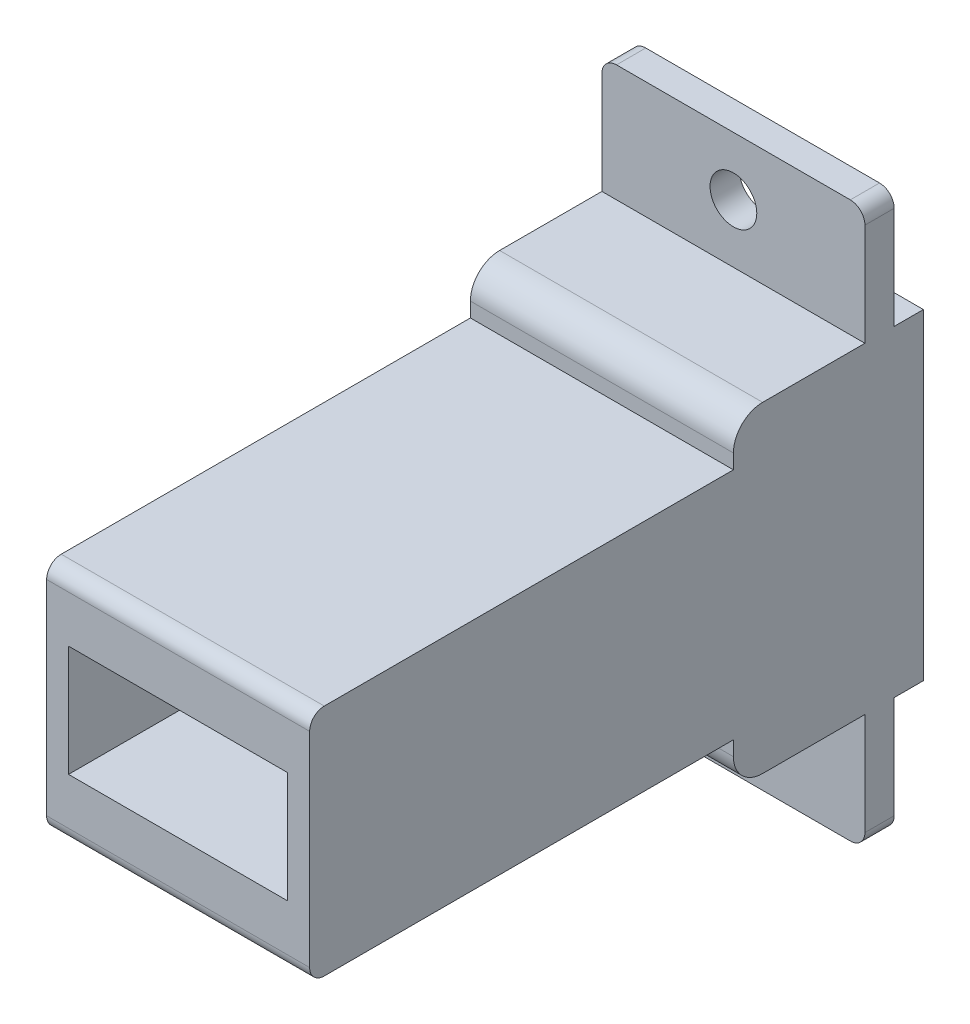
ISO-10303-21;
HEADER;
FILE_DESCRIPTION(('STEP AP214'),'2;1');
FILE_NAME('part.step','',(''),(''),'','','');
FILE_SCHEMA(('AUTOMOTIVE_DESIGN { 1 0 10303 214 1 1 1 1 }'));
ENDSEC;
DATA;
#1=APPLICATION_CONTEXT('core data for automotive mechanical design processes');
#2=APPLICATION_PROTOCOL_DEFINITION('international standard','automotive_design',2000,#1);
#3=PRODUCT_CONTEXT('',#1,'mechanical');
#4=PRODUCT('Part','Part','',(#3));
#5=PRODUCT_RELATED_PRODUCT_CATEGORY('part','',(#4));
#6=PRODUCT_DEFINITION_FORMATION('','',#4);
#7=PRODUCT_DEFINITION_CONTEXT('part definition',#1,'design');
#8=PRODUCT_DEFINITION('design','',#6,#7);
#9=PRODUCT_DEFINITION_SHAPE('','',#8);
#10=(LENGTH_UNIT() NAMED_UNIT(*) SI_UNIT(.MILLI.,.METRE.));
#11=(NAMED_UNIT(*) PLANE_ANGLE_UNIT() SI_UNIT($,.RADIAN.));
#12=(NAMED_UNIT(*) SI_UNIT($,.STERADIAN.) SOLID_ANGLE_UNIT());
#13=UNCERTAINTY_MEASURE_WITH_UNIT(LENGTH_MEASURE(1.E-05),#10,'distance_accuracy_value','');
#14=(GEOMETRIC_REPRESENTATION_CONTEXT(3) GLOBAL_UNCERTAINTY_ASSIGNED_CONTEXT((#13)) GLOBAL_UNIT_ASSIGNED_CONTEXT((#10,
#11,#12)) REPRESENTATION_CONTEXT('',''));
#15=CARTESIAN_POINT('',(0.,0.,0.));
#16=DIRECTION('',(0.,0.,1.));
#17=DIRECTION('',(1.,0.,0.));
#18=AXIS2_PLACEMENT_3D('',#15,#16,#17);
#19=CARTESIAN_POINT('',(0.,0.,0.));
#20=DIRECTION('',(0.,0.,-1.));
#21=DIRECTION('',(-1.,0.,0.));
#22=AXIS2_PLACEMENT_3D('',#19,#20,#21);
#23=PLANE('',#22);
#24=CARTESIAN_POINT('',(0.,15.,0.));
#25=DIRECTION('',(0.,0.,1.));
#26=DIRECTION('',(1.,0.,0.));
#27=AXIS2_PLACEMENT_3D('',#24,#25,#26);
#28=CIRCLE('',#27,1.6);
#29=CARTESIAN_POINT('',(1.6,15.,0.));
#30=VERTEX_POINT('',#29);
#31=EDGE_CURVE('E312',#30,#30,#28,.T.);
#32=ORIENTED_EDGE('',*,*,#31,.T.);
#33=EDGE_LOOP('',(#32));
#34=FACE_BOUND('',#33,.T.);
#35=DIRECTION('',(0.,1.,0.));
#36=VECTOR('',#35,1.);
#37=CARTESIAN_POINT('',(9.,-19.,0.));
#38=LINE('',#37,#36);
#39=CARTESIAN_POINT('',(9.,11.,0.));
#40=VERTEX_POINT('',#39);
#41=CARTESIAN_POINT('',(9.,18.,0.));
#42=VERTEX_POINT('',#41);
#43=EDGE_CURVE('E246',#40,#42,#38,.T.);
#44=ORIENTED_EDGE('',*,*,#43,.F.);
#45=DIRECTION('',(-1.,0.,0.));
#46=VECTOR('',#45,1.);
#47=CARTESIAN_POINT('',(9.,11.,0.));
#48=LINE('',#47,#46);
#49=CARTESIAN_POINT('',(-9.,11.,0.));
#50=VERTEX_POINT('',#49);
#51=EDGE_CURVE('E687',#40,#50,#48,.T.);
#52=ORIENTED_EDGE('',*,*,#51,.T.);
#53=DIRECTION('',(0.,-1.,0.));
#54=VECTOR('',#53,1.);
#55=CARTESIAN_POINT('',(-9.,-19.,0.));
#56=LINE('',#55,#54);
#57=CARTESIAN_POINT('',(-9.,18.,0.));
#58=VERTEX_POINT('',#57);
#59=EDGE_CURVE('E270',#58,#50,#56,.T.);
#60=ORIENTED_EDGE('',*,*,#59,.F.);
#61=CARTESIAN_POINT('',(-8.,18.,0.));
#62=DIRECTION('',(0.,0.,-1.));
#63=DIRECTION('',(-1.,0.,0.));
#64=AXIS2_PLACEMENT_3D('',#61,#62,#63);
#65=CIRCLE('',#64,1.);
#66=CARTESIAN_POINT('',(-8.,19.,0.));
#67=VERTEX_POINT('',#66);
#68=EDGE_CURVE('E291',#58,#67,#65,.T.);
#69=ORIENTED_EDGE('',*,*,#68,.T.);
#70=DIRECTION('',(-1.,0.,0.));
#71=VECTOR('',#70,1.);
#72=CARTESIAN_POINT('',(-9.,19.,0.));
#73=LINE('',#72,#71);
#74=CARTESIAN_POINT('',(8.,19.,0.));
#75=VERTEX_POINT('',#74);
#76=EDGE_CURVE('E245',#75,#67,#73,.T.);
#77=ORIENTED_EDGE('',*,*,#76,.F.);
#78=CARTESIAN_POINT('',(8.,18.,0.));
#79=DIRECTION('',(0.,0.,-1.));
#80=DIRECTION('',(-1.,0.,0.));
#81=AXIS2_PLACEMENT_3D('',#78,#79,#80);
#82=CIRCLE('',#81,1.);
#83=EDGE_CURVE('E662',#75,#42,#82,.T.);
#84=ORIENTED_EDGE('',*,*,#83,.T.);
#85=EDGE_LOOP('',(#44,#52,#60,#69,#77,#84));
#86=FACE_BOUND('',#85,.T.);
#87=ADVANCED_FACE('F32',(#34,#86),#23,.T.);
#88=CARTESIAN_POINT('',(0.,0.,2.));
#89=DIRECTION('',(0.,0.,-1.));
#90=DIRECTION('',(-1.,0.,0.));
#91=AXIS2_PLACEMENT_3D('',#88,#89,#90);
#92=PLANE('',#91);
#93=CARTESIAN_POINT('',(0.,15.,2.));
#94=DIRECTION('',(0.,0.,1.));
#95=DIRECTION('',(1.,0.,0.));
#96=AXIS2_PLACEMENT_3D('',#93,#94,#95);
#97=CIRCLE('',#96,1.6);
#98=CARTESIAN_POINT('',(1.6,15.,2.));
#99=VERTEX_POINT('',#98);
#100=EDGE_CURVE('E250',#99,#99,#97,.T.);
#101=ORIENTED_EDGE('',*,*,#100,.F.);
#102=EDGE_LOOP('',(#101));
#103=FACE_BOUND('',#102,.T.);
#104=DIRECTION('',(-1.,0.,0.));
#105=VECTOR('',#104,1.);
#106=CARTESIAN_POINT('',(9.,11.,2.));
#107=LINE('',#106,#105);
#108=CARTESIAN_POINT('',(9.,11.,2.));
#109=VERTEX_POINT('',#108);
#110=CARTESIAN_POINT('',(-9.,11.,2.));
#111=VERTEX_POINT('',#110);
#112=EDGE_CURVE('E359',#109,#111,#107,.T.);
#113=ORIENTED_EDGE('',*,*,#112,.F.);
#114=DIRECTION('',(0.,1.,0.));
#115=VECTOR('',#114,1.);
#116=CARTESIAN_POINT('',(9.,-19.,2.));
#117=LINE('',#116,#115);
#118=CARTESIAN_POINT('',(9.,18.,2.));
#119=VERTEX_POINT('',#118);
#120=EDGE_CURVE('E276',#109,#119,#117,.T.);
#121=ORIENTED_EDGE('',*,*,#120,.T.);
#122=CARTESIAN_POINT('',(8.,18.,2.));
#123=DIRECTION('',(0.,0.,-1.));
#124=DIRECTION('',(-1.,0.,0.));
#125=AXIS2_PLACEMENT_3D('',#122,#123,#124);
#126=CIRCLE('',#125,1.);
#127=CARTESIAN_POINT('',(8.,19.,2.));
#128=VERTEX_POINT('',#127);
#129=EDGE_CURVE('E674',#119,#128,#126,.F.);
#130=ORIENTED_EDGE('',*,*,#129,.T.);
#131=DIRECTION('',(-1.,0.,0.));
#132=VECTOR('',#131,1.);
#133=CARTESIAN_POINT('',(-9.,19.,2.));
#134=LINE('',#133,#132);
#135=CARTESIAN_POINT('',(-8.,19.,2.));
#136=VERTEX_POINT('',#135);
#137=EDGE_CURVE('E307',#128,#136,#134,.T.);
#138=ORIENTED_EDGE('',*,*,#137,.T.);
#139=CARTESIAN_POINT('',(-8.,18.,2.));
#140=DIRECTION('',(0.,0.,-1.));
#141=DIRECTION('',(-1.,0.,0.));
#142=AXIS2_PLACEMENT_3D('',#139,#140,#141);
#143=CIRCLE('',#142,1.);
#144=CARTESIAN_POINT('',(-9.,18.,2.));
#145=VERTEX_POINT('',#144);
#146=EDGE_CURVE('E676',#136,#145,#143,.F.);
#147=ORIENTED_EDGE('',*,*,#146,.T.);
#148=DIRECTION('',(0.,-1.,0.));
#149=VECTOR('',#148,1.);
#150=CARTESIAN_POINT('',(-9.,-19.,2.));
#151=LINE('',#150,#149);
#152=EDGE_CURVE('E321',#145,#111,#151,.T.);
#153=ORIENTED_EDGE('',*,*,#152,.T.);
#154=EDGE_LOOP('',(#113,#121,#130,#138,#147,#153));
#155=FACE_BOUND('',#154,.T.);
#156=ADVANCED_FACE('F397',(#103,#155),#92,.F.);
#157=CARTESIAN_POINT('',(9.,-18.,2.));
#158=VERTEX_POINT('',#157);
#159=CARTESIAN_POINT('',(9.,-11.,2.));
#160=VERTEX_POINT('',#159);
#161=EDGE_CURVE('E303',#158,#160,#117,.T.);
#162=ORIENTED_EDGE('',*,*,#161,.T.);
#163=DIRECTION('',(-1.,0.,0.));
#164=VECTOR('',#163,1.);
#165=CARTESIAN_POINT('',(9.,-11.,2.));
#166=LINE('',#165,#164);
#167=CARTESIAN_POINT('',(-9.,-11.,2.));
#168=VERTEX_POINT('',#167);
#169=EDGE_CURVE('E334',#160,#168,#166,.T.);
#170=ORIENTED_EDGE('',*,*,#169,.T.);
#171=CARTESIAN_POINT('',(-9.,-18.,2.));
#172=VERTEX_POINT('',#171);
#173=EDGE_CURVE('E316',#168,#172,#151,.T.);
#174=ORIENTED_EDGE('',*,*,#173,.T.);
#175=CARTESIAN_POINT('',(-8.,-18.,2.));
#176=DIRECTION('',(0.,0.,-1.));
#177=DIRECTION('',(-1.,0.,0.));
#178=AXIS2_PLACEMENT_3D('',#175,#176,#177);
#179=CIRCLE('',#178,1.);
#180=CARTESIAN_POINT('',(-8.,-19.,2.));
#181=VERTEX_POINT('',#180);
#182=EDGE_CURVE('E294',#172,#181,#179,.F.);
#183=ORIENTED_EDGE('',*,*,#182,.T.);
#184=DIRECTION('',(1.,0.,0.));
#185=VECTOR('',#184,1.);
#186=CARTESIAN_POINT('',(-9.,-19.,2.));
#187=LINE('',#186,#185);
#188=CARTESIAN_POINT('',(8.,-19.,2.));
#189=VERTEX_POINT('',#188);
#190=EDGE_CURVE('E259',#181,#189,#187,.T.);
#191=ORIENTED_EDGE('',*,*,#190,.T.);
#192=CARTESIAN_POINT('',(8.,-18.,2.));
#193=DIRECTION('',(0.,0.,-1.));
#194=DIRECTION('',(-1.,0.,0.));
#195=AXIS2_PLACEMENT_3D('',#192,#193,#194);
#196=CIRCLE('',#195,1.);
#197=EDGE_CURVE('E299',#189,#158,#196,.F.);
#198=ORIENTED_EDGE('',*,*,#197,.T.);
#199=EDGE_LOOP('',(#162,#170,#174,#183,#191,#198));
#200=FACE_BOUND('',#199,.T.);
#201=CARTESIAN_POINT('',(0.,-15.,2.));
#202=DIRECTION('',(0.,0.,1.));
#203=DIRECTION('',(1.,0.,0.));
#204=AXIS2_PLACEMENT_3D('',#201,#202,#203);
#205=CIRCLE('',#204,1.6);
#206=CARTESIAN_POINT('',(1.6,-15.,2.));
#207=VERTEX_POINT('',#206);
#208=EDGE_CURVE('E369',#207,#207,#205,.T.);
#209=ORIENTED_EDGE('',*,*,#208,.F.);
#210=EDGE_LOOP('',(#209));
#211=FACE_BOUND('',#210,.T.);
#212=ADVANCED_FACE('F330',(#200,#211),#92,.F.);
#213=DIRECTION('',(-1.,0.,0.));
#214=VECTOR('',#213,1.);
#215=CARTESIAN_POINT('',(9.,-11.,0.));
#216=LINE('',#215,#214);
#217=CARTESIAN_POINT('',(9.,-11.,0.));
#218=VERTEX_POINT('',#217);
#219=CARTESIAN_POINT('',(-9.,-11.,0.));
#220=VERTEX_POINT('',#219);
#221=EDGE_CURVE('E223',#218,#220,#216,.T.);
#222=ORIENTED_EDGE('',*,*,#221,.F.);
#223=CARTESIAN_POINT('',(9.,-18.,0.));
#224=VERTEX_POINT('',#223);
#225=EDGE_CURVE('E236',#224,#218,#38,.T.);
#226=ORIENTED_EDGE('',*,*,#225,.F.);
#227=CARTESIAN_POINT('',(8.,-18.,0.));
#228=DIRECTION('',(0.,0.,-1.));
#229=DIRECTION('',(-1.,0.,0.));
#230=AXIS2_PLACEMENT_3D('',#227,#228,#229);
#231=CIRCLE('',#230,1.);
#232=CARTESIAN_POINT('',(8.,-19.,0.));
#233=VERTEX_POINT('',#232);
#234=EDGE_CURVE('E290',#224,#233,#231,.T.);
#235=ORIENTED_EDGE('',*,*,#234,.T.);
#236=DIRECTION('',(1.,0.,0.));
#237=VECTOR('',#236,1.);
#238=CARTESIAN_POINT('',(-9.,-19.,0.));
#239=LINE('',#238,#237);
#240=CARTESIAN_POINT('',(-8.,-19.,0.));
#241=VERTEX_POINT('',#240);
#242=EDGE_CURVE('E265',#241,#233,#239,.T.);
#243=ORIENTED_EDGE('',*,*,#242,.F.);
#244=CARTESIAN_POINT('',(-8.,-18.,0.));
#245=DIRECTION('',(0.,0.,-1.));
#246=DIRECTION('',(-1.,0.,0.));
#247=AXIS2_PLACEMENT_3D('',#244,#245,#246);
#248=CIRCLE('',#247,1.);
#249=CARTESIAN_POINT('',(-9.,-18.,0.));
#250=VERTEX_POINT('',#249);
#251=EDGE_CURVE('E286',#241,#250,#248,.T.);
#252=ORIENTED_EDGE('',*,*,#251,.T.);
#253=EDGE_CURVE('E238',#220,#250,#56,.T.);
#254=ORIENTED_EDGE('',*,*,#253,.F.);
#255=EDGE_LOOP('',(#222,#226,#235,#243,#252,#254));
#256=FACE_BOUND('',#255,.T.);
#257=CARTESIAN_POINT('',(0.,-15.,0.));
#258=DIRECTION('',(0.,0.,1.));
#259=DIRECTION('',(1.,0.,0.));
#260=AXIS2_PLACEMENT_3D('',#257,#258,#259);
#261=CIRCLE('',#260,1.6);
#262=CARTESIAN_POINT('',(1.6,-15.,0.));
#263=VERTEX_POINT('',#262);
#264=EDGE_CURVE('E362',#263,#263,#261,.T.);
#265=ORIENTED_EDGE('',*,*,#264,.T.);
#266=EDGE_LOOP('',(#265));
#267=FACE_BOUND('',#266,.T.);
#268=ADVANCED_FACE('F234',(#256,#267),#23,.T.);
#269=CARTESIAN_POINT('',(9.,-19.,2.));
#270=DIRECTION('',(-1.,0.,0.));
#271=DIRECTION('',(0.,0.,1.));
#272=AXIS2_PLACEMENT_3D('',#269,#270,#271);
#273=PLANE('',#272);
#274=ORIENTED_EDGE('',*,*,#161,.F.);
#275=DIRECTION('',(0.,0.,-1.));
#276=VECTOR('',#275,1.);
#277=CARTESIAN_POINT('',(9.,-18.,2.));
#278=LINE('',#277,#276);
#279=EDGE_CURVE('E244',#158,#224,#278,.T.);
#280=ORIENTED_EDGE('',*,*,#279,.T.);
#281=ORIENTED_EDGE('',*,*,#225,.T.);
#282=DIRECTION('',(0.,0.,-1.));
#283=VECTOR('',#282,1.);
#284=CARTESIAN_POINT('',(9.,-11.,-2.));
#285=LINE('',#284,#283);
#286=CARTESIAN_POINT('',(9.,-11.,-2.));
#287=VERTEX_POINT('',#286);
#288=EDGE_CURVE('E220',#218,#287,#285,.T.);
#289=ORIENTED_EDGE('',*,*,#288,.T.);
#290=DIRECTION('',(0.,1.,0.));
#291=VECTOR('',#290,1.);
#292=CARTESIAN_POINT('',(9.,11.,-2.));
#293=LINE('',#292,#291);
#294=CARTESIAN_POINT('',(9.,11.,-2.));
#295=VERTEX_POINT('',#294);
#296=EDGE_CURVE('E230',#287,#295,#293,.T.);
#297=ORIENTED_EDGE('',*,*,#296,.T.);
#298=DIRECTION('',(0.,0.,1.));
#299=VECTOR('',#298,1.);
#300=CARTESIAN_POINT('',(9.,11.,0.));
#301=LINE('',#300,#299);
#302=EDGE_CURVE('E690',#295,#40,#301,.T.);
#303=ORIENTED_EDGE('',*,*,#302,.T.);
#304=ORIENTED_EDGE('',*,*,#43,.T.);
#305=DIRECTION('',(0.,0.,-1.));
#306=VECTOR('',#305,1.);
#307=CARTESIAN_POINT('',(9.,18.,2.));
#308=LINE('',#307,#306);
#309=EDGE_CURVE('E327',#42,#119,#308,.F.);
#310=ORIENTED_EDGE('',*,*,#309,.T.);
#311=ORIENTED_EDGE('',*,*,#120,.F.);
#312=DIRECTION('',(0.,0.,1.));
#313=VECTOR('',#312,1.);
#314=CARTESIAN_POINT('',(9.,11.,2.));
#315=LINE('',#314,#313);
#316=CARTESIAN_POINT('',(9.,11.,8.99999999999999));
#317=VERTEX_POINT('',#316);
#318=EDGE_CURVE('E342',#109,#317,#315,.T.);
#319=ORIENTED_EDGE('',*,*,#318,.T.);
#320=CARTESIAN_POINT('',(9.,9.,9.));
#321=DIRECTION('',(1.,0.,0.));
#322=DIRECTION('',(0.,0.,-1.));
#323=AXIS2_PLACEMENT_3D('',#320,#321,#322);
#324=CIRCLE('',#323,2.);
#325=CARTESIAN_POINT('',(9.,8.99999999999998,11.));
#326=VERTEX_POINT('',#325);
#327=EDGE_CURVE('E344',#317,#326,#324,.T.);
#328=ORIENTED_EDGE('',*,*,#327,.T.);
#329=DIRECTION('',(0.,-1.,0.));
#330=VECTOR('',#329,1.);
#331=CARTESIAN_POINT('',(9.,8.99999999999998,11.));
#332=LINE('',#331,#330);
#333=CARTESIAN_POINT('',(9.,8.,11.));
#334=VERTEX_POINT('',#333);
#335=EDGE_CURVE('E639',#326,#334,#332,.T.);
#336=ORIENTED_EDGE('',*,*,#335,.T.);
#337=DIRECTION('',(0.,0.,1.));
#338=VECTOR('',#337,1.);
#339=CARTESIAN_POINT('',(9.,8.,11.));
#340=LINE('',#339,#338);
#341=CARTESIAN_POINT('',(9.,7.99999999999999,39.));
#342=VERTEX_POINT('',#341);
#343=EDGE_CURVE('E641',#334,#342,#340,.T.);
#344=ORIENTED_EDGE('',*,*,#343,.T.);
#345=CARTESIAN_POINT('',(9.,6.99999999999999,39.));
#346=DIRECTION('',(1.,0.,0.));
#347=DIRECTION('',(0.,0.,-1.));
#348=AXIS2_PLACEMENT_3D('',#345,#346,#347);
#349=CIRCLE('',#348,1.);
#350=CARTESIAN_POINT('',(9.,6.99999999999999,40.));
#351=VERTEX_POINT('',#350);
#352=EDGE_CURVE('E643',#342,#351,#349,.T.);
#353=ORIENTED_EDGE('',*,*,#352,.T.);
#354=DIRECTION('',(0.,-1.,0.));
#355=VECTOR('',#354,1.);
#356=CARTESIAN_POINT('',(9.,6.99999999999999,40.));
#357=LINE('',#356,#355);
#358=CARTESIAN_POINT('',(9.,-7.,40.));
#359=VERTEX_POINT('',#358);
#360=EDGE_CURVE('E649',#351,#359,#357,.T.);
#361=ORIENTED_EDGE('',*,*,#360,.T.);
#362=CARTESIAN_POINT('',(9.,-7.00000000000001,39.));
#363=DIRECTION('',(1.,0.,0.));
#364=DIRECTION('',(0.,0.,1.));
#365=AXIS2_PLACEMENT_3D('',#362,#363,#364);
#366=CIRCLE('',#365,1.);
#367=CARTESIAN_POINT('',(9.,-8.00000000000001,39.));
#368=VERTEX_POINT('',#367);
#369=EDGE_CURVE('E651',#359,#368,#366,.T.);
#370=ORIENTED_EDGE('',*,*,#369,.T.);
#371=DIRECTION('',(0.,0.,-1.));
#372=VECTOR('',#371,1.);
#373=CARTESIAN_POINT('',(9.,-8.,11.));
#374=LINE('',#373,#372);
#375=CARTESIAN_POINT('',(9.,-8.,11.));
#376=VERTEX_POINT('',#375);
#377=EDGE_CURVE('E653',#368,#376,#374,.T.);
#378=ORIENTED_EDGE('',*,*,#377,.T.);
#379=DIRECTION('',(0.,-1.,0.));
#380=VECTOR('',#379,1.);
#381=CARTESIAN_POINT('',(9.,-8.,11.));
#382=LINE('',#381,#380);
#383=CARTESIAN_POINT('',(9.,-8.99999999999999,11.));
#384=VERTEX_POINT('',#383);
#385=EDGE_CURVE('E654',#376,#384,#382,.T.);
#386=ORIENTED_EDGE('',*,*,#385,.T.);
#387=CARTESIAN_POINT('',(9.,-9.,9.));
#388=DIRECTION('',(1.,0.,0.));
#389=DIRECTION('',(0.,0.,1.));
#390=AXIS2_PLACEMENT_3D('',#387,#388,#389);
#391=CIRCLE('',#390,2.);
#392=CARTESIAN_POINT('',(9.,-11.,8.99999999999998));
#393=VERTEX_POINT('',#392);
#394=EDGE_CURVE('E354',#384,#393,#391,.T.);
#395=ORIENTED_EDGE('',*,*,#394,.T.);
#396=DIRECTION('',(0.,0.,-1.));
#397=VECTOR('',#396,1.);
#398=CARTESIAN_POINT('',(9.,-11.,2.));
#399=LINE('',#398,#397);
#400=EDGE_CURVE('E352',#393,#160,#399,.T.);
#401=ORIENTED_EDGE('',*,*,#400,.T.);
#402=EDGE_LOOP('',(#274,#280,#281,#289,#297,#303,#304,#310,#311,#319,#328,#336,#344,#353,#361,
#370,#378,#386,#395,#401));
#403=FACE_BOUND('',#402,.T.);
#404=ADVANCED_FACE('F242',(#403),#273,.F.);
#405=CARTESIAN_POINT('',(-9.,19.,2.));
#406=DIRECTION('',(0.,-1.,0.));
#407=DIRECTION('',(0.,0.,-1.));
#408=AXIS2_PLACEMENT_3D('',#405,#406,#407);
#409=PLANE('',#408);
#410=ORIENTED_EDGE('',*,*,#76,.T.);
#411=DIRECTION('',(0.,0.,-1.));
#412=VECTOR('',#411,1.);
#413=CARTESIAN_POINT('',(-8.,19.,2.));
#414=LINE('',#413,#412);
#415=EDGE_CURVE('E11',#67,#136,#414,.F.);
#416=ORIENTED_EDGE('',*,*,#415,.T.);
#417=ORIENTED_EDGE('',*,*,#137,.F.);
#418=DIRECTION('',(0.,0.,-1.));
#419=VECTOR('',#418,1.);
#420=CARTESIAN_POINT('',(8.,19.,2.));
#421=LINE('',#420,#419);
#422=EDGE_CURVE('E41',#128,#75,#421,.T.);
#423=ORIENTED_EDGE('',*,*,#422,.T.);
#424=EDGE_LOOP('',(#410,#416,#417,#423));
#425=FACE_BOUND('',#424,.T.);
#426=ADVANCED_FACE('F408',(#425),#409,.F.);
#427=CARTESIAN_POINT('',(-9.,-19.,2.));
#428=DIRECTION('',(1.,0.,0.));
#429=DIRECTION('',(0.,0.,-1.));
#430=AXIS2_PLACEMENT_3D('',#427,#428,#429);
#431=PLANE('',#430);
#432=ORIENTED_EDGE('',*,*,#59,.T.);
#433=DIRECTION('',(0.,0.,1.));
#434=VECTOR('',#433,1.);
#435=CARTESIAN_POINT('',(-9.,11.,0.));
#436=LINE('',#435,#434);
#437=CARTESIAN_POINT('',(-9.,11.,-2.));
#438=VERTEX_POINT('',#437);
#439=EDGE_CURVE('E49',#438,#50,#436,.T.);
#440=ORIENTED_EDGE('',*,*,#439,.F.);
#441=DIRECTION('',(0.,1.,0.));
#442=VECTOR('',#441,1.);
#443=CARTESIAN_POINT('',(-9.,11.,-2.));
#444=LINE('',#443,#442);
#445=CARTESIAN_POINT('',(-9.,-11.,-2.));
#446=VERTEX_POINT('',#445);
#447=EDGE_CURVE('E700',#446,#438,#444,.T.);
#448=ORIENTED_EDGE('',*,*,#447,.F.);
#449=DIRECTION('',(0.,0.,-1.));
#450=VECTOR('',#449,1.);
#451=CARTESIAN_POINT('',(-9.,-11.,-2.));
#452=LINE('',#451,#450);
#453=EDGE_CURVE('E284',#220,#446,#452,.T.);
#454=ORIENTED_EDGE('',*,*,#453,.F.);
#455=ORIENTED_EDGE('',*,*,#253,.T.);
#456=DIRECTION('',(0.,0.,-1.));
#457=VECTOR('',#456,1.);
#458=CARTESIAN_POINT('',(-9.,-18.,2.));
#459=LINE('',#458,#457);
#460=EDGE_CURVE('E281',#250,#172,#459,.F.);
#461=ORIENTED_EDGE('',*,*,#460,.T.);
#462=ORIENTED_EDGE('',*,*,#173,.F.);
#463=DIRECTION('',(0.,0.,-1.));
#464=VECTOR('',#463,1.);
#465=CARTESIAN_POINT('',(-9.,-11.,2.));
#466=LINE('',#465,#464);
#467=CARTESIAN_POINT('',(-9.,-11.,8.99999999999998));
#468=VERTEX_POINT('',#467);
#469=EDGE_CURVE('E337',#468,#168,#466,.T.);
#470=ORIENTED_EDGE('',*,*,#469,.F.);
#471=CARTESIAN_POINT('',(-9.,-9.,9.));
#472=DIRECTION('',(1.,0.,0.));
#473=DIRECTION('',(0.,0.,1.));
#474=AXIS2_PLACEMENT_3D('',#471,#472,#473);
#475=CIRCLE('',#474,2.);
#476=CARTESIAN_POINT('',(-9.,-8.99999999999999,11.));
#477=VERTEX_POINT('',#476);
#478=EDGE_CURVE('E339',#477,#468,#475,.T.);
#479=ORIENTED_EDGE('',*,*,#478,.F.);
#480=DIRECTION('',(0.,-1.,0.));
#481=VECTOR('',#480,1.);
#482=CARTESIAN_POINT('',(-9.,-8.,11.));
#483=LINE('',#482,#481);
#484=CARTESIAN_POINT('',(-9.,-8.,11.));
#485=VERTEX_POINT('',#484);
#486=EDGE_CURVE('E346',#485,#477,#483,.T.);
#487=ORIENTED_EDGE('',*,*,#486,.F.);
#488=DIRECTION('',(0.,0.,-1.));
#489=VECTOR('',#488,1.);
#490=CARTESIAN_POINT('',(-9.,-8.,11.));
#491=LINE('',#490,#489);
#492=CARTESIAN_POINT('',(-9.,-8.00000000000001,39.));
#493=VERTEX_POINT('',#492);
#494=EDGE_CURVE('E611',#493,#485,#491,.T.);
#495=ORIENTED_EDGE('',*,*,#494,.F.);
#496=CARTESIAN_POINT('',(-9.,-7.00000000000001,39.));
#497=DIRECTION('',(1.,0.,0.));
#498=DIRECTION('',(0.,0.,1.));
#499=AXIS2_PLACEMENT_3D('',#496,#497,#498);
#500=CIRCLE('',#499,1.);
#501=CARTESIAN_POINT('',(-9.,-7.,40.));
#502=VERTEX_POINT('',#501);
#503=EDGE_CURVE('E609',#502,#493,#500,.T.);
#504=ORIENTED_EDGE('',*,*,#503,.F.);
#505=DIRECTION('',(0.,-1.,0.));
#506=VECTOR('',#505,1.);
#507=CARTESIAN_POINT('',(-9.,6.99999999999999,40.));
#508=LINE('',#507,#506);
#509=CARTESIAN_POINT('',(-9.,6.99999999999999,40.));
#510=VERTEX_POINT('',#509);
#511=EDGE_CURVE('E607',#510,#502,#508,.T.);
#512=ORIENTED_EDGE('',*,*,#511,.F.);
#513=CARTESIAN_POINT('',(-9.,6.99999999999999,39.));
#514=DIRECTION('',(1.,0.,0.));
#515=DIRECTION('',(0.,0.,-1.));
#516=AXIS2_PLACEMENT_3D('',#513,#514,#515);
#517=CIRCLE('',#516,1.);
#518=CARTESIAN_POINT('',(-9.,7.99999999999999,39.));
#519=VERTEX_POINT('',#518);
#520=EDGE_CURVE('E605',#519,#510,#517,.T.);
#521=ORIENTED_EDGE('',*,*,#520,.F.);
#522=DIRECTION('',(0.,0.,1.));
#523=VECTOR('',#522,1.);
#524=CARTESIAN_POINT('',(-9.,8.,11.));
#525=LINE('',#524,#523);
#526=CARTESIAN_POINT('',(-9.,8.,11.));
#527=VERTEX_POINT('',#526);
#528=EDGE_CURVE('E599',#527,#519,#525,.T.);
#529=ORIENTED_EDGE('',*,*,#528,.F.);
#530=DIRECTION('',(0.,-1.,0.));
#531=VECTOR('',#530,1.);
#532=CARTESIAN_POINT('',(-9.,8.99999999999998,11.));
#533=LINE('',#532,#531);
#534=CARTESIAN_POINT('',(-9.,8.99999999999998,11.));
#535=VERTEX_POINT('',#534);
#536=EDGE_CURVE('E597',#535,#527,#533,.T.);
#537=ORIENTED_EDGE('',*,*,#536,.F.);
#538=CARTESIAN_POINT('',(-9.,9.,9.));
#539=DIRECTION('',(1.,0.,0.));
#540=DIRECTION('',(0.,0.,-1.));
#541=AXIS2_PLACEMENT_3D('',#538,#539,#540);
#542=CIRCLE('',#541,2.);
#543=CARTESIAN_POINT('',(-9.,11.,8.99999999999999));
#544=VERTEX_POINT('',#543);
#545=EDGE_CURVE('E590',#544,#535,#542,.T.);
#546=ORIENTED_EDGE('',*,*,#545,.F.);
#547=DIRECTION('',(0.,0.,1.));
#548=VECTOR('',#547,1.);
#549=CARTESIAN_POINT('',(-9.,11.,2.));
#550=LINE('',#549,#548);
#551=EDGE_CURVE('E364',#111,#544,#550,.T.);
#552=ORIENTED_EDGE('',*,*,#551,.F.);
#553=ORIENTED_EDGE('',*,*,#152,.F.);
#554=DIRECTION('',(0.,0.,-1.));
#555=VECTOR('',#554,1.);
#556=CARTESIAN_POINT('',(-9.,18.,2.));
#557=LINE('',#556,#555);
#558=EDGE_CURVE('E295',#145,#58,#557,.T.);
#559=ORIENTED_EDGE('',*,*,#558,.T.);
#560=EDGE_LOOP('',(#432,#440,#448,#454,#455,#461,#462,#470,#479,#487,#495,#504,#512,#521,#529,
#537,#546,#552,#553,#559));
#561=FACE_BOUND('',#560,.T.);
#562=ADVANCED_FACE('F278',(#561),#431,.F.);
#563=CARTESIAN_POINT('',(-9.,-19.,2.));
#564=DIRECTION('',(0.,1.,0.));
#565=DIRECTION('',(0.,0.,1.));
#566=AXIS2_PLACEMENT_3D('',#563,#564,#565);
#567=PLANE('',#566);
#568=ORIENTED_EDGE('',*,*,#242,.T.);
#569=DIRECTION('',(0.,0.,-1.));
#570=VECTOR('',#569,1.);
#571=CARTESIAN_POINT('',(8.,-19.,2.));
#572=LINE('',#571,#570);
#573=EDGE_CURVE('E672',#233,#189,#572,.F.);
#574=ORIENTED_EDGE('',*,*,#573,.T.);
#575=ORIENTED_EDGE('',*,*,#190,.F.);
#576=DIRECTION('',(0.,0.,-1.));
#577=VECTOR('',#576,1.);
#578=CARTESIAN_POINT('',(-8.,-19.,2.));
#579=LINE('',#578,#577);
#580=EDGE_CURVE('E670',#181,#241,#579,.T.);
#581=ORIENTED_EDGE('',*,*,#580,.T.);
#582=EDGE_LOOP('',(#568,#574,#575,#581));
#583=FACE_BOUND('',#582,.T.);
#584=ADVANCED_FACE('F384',(#583),#567,.F.);
#585=CARTESIAN_POINT('',(0.,15.,2.));
#586=DIRECTION('',(0.,0.,-1.));
#587=DIRECTION('',(-1.,0.,0.));
#588=AXIS2_PLACEMENT_3D('',#585,#586,#587);
#589=CYLINDRICAL_SURFACE('',#588,1.6);
#590=ORIENTED_EDGE('',*,*,#100,.T.);
#591=EDGE_LOOP('',(#590));
#592=FACE_BOUND('',#591,.T.);
#593=ORIENTED_EDGE('',*,*,#31,.F.);
#594=EDGE_LOOP('',(#593));
#595=FACE_BOUND('',#594,.T.);
#596=ADVANCED_FACE('F381',(#592,#595),#589,.F.);
#597=CARTESIAN_POINT('',(0.,-15.,2.));
#598=DIRECTION('',(0.,0.,-1.));
#599=DIRECTION('',(-1.,0.,0.));
#600=AXIS2_PLACEMENT_3D('',#597,#598,#599);
#601=CYLINDRICAL_SURFACE('',#600,1.6);
#602=ORIENTED_EDGE('',*,*,#208,.T.);
#603=EDGE_LOOP('',(#602));
#604=FACE_BOUND('',#603,.T.);
#605=ORIENTED_EDGE('',*,*,#264,.F.);
#606=EDGE_LOOP('',(#605));
#607=FACE_BOUND('',#606,.T.);
#608=ADVANCED_FACE('F383',(#604,#607),#601,.F.);
#609=CARTESIAN_POINT('',(8.,-18.,2.));
#610=DIRECTION('',(0.,0.,-1.));
#611=DIRECTION('',(-1.,0.,0.));
#612=AXIS2_PLACEMENT_3D('',#609,#610,#611);
#613=CYLINDRICAL_SURFACE('',#612,1.);
#614=ORIENTED_EDGE('',*,*,#197,.F.);
#615=ORIENTED_EDGE('',*,*,#573,.F.);
#616=ORIENTED_EDGE('',*,*,#234,.F.);
#617=ORIENTED_EDGE('',*,*,#279,.F.);
#618=EDGE_LOOP('',(#614,#615,#616,#617));
#619=FACE_BOUND('',#618,.T.);
#620=ADVANCED_FACE('F390',(#619),#613,.T.);
#621=CARTESIAN_POINT('',(-8.,-18.,2.));
#622=DIRECTION('',(0.,0.,-1.));
#623=DIRECTION('',(-1.,0.,0.));
#624=AXIS2_PLACEMENT_3D('',#621,#622,#623);
#625=CYLINDRICAL_SURFACE('',#624,1.);
#626=ORIENTED_EDGE('',*,*,#182,.F.);
#627=ORIENTED_EDGE('',*,*,#460,.F.);
#628=ORIENTED_EDGE('',*,*,#251,.F.);
#629=ORIENTED_EDGE('',*,*,#580,.F.);
#630=EDGE_LOOP('',(#626,#627,#628,#629));
#631=FACE_BOUND('',#630,.T.);
#632=ADVANCED_FACE('F293',(#631),#625,.T.);
#633=CARTESIAN_POINT('',(-8.,18.,2.));
#634=DIRECTION('',(0.,0.,-1.));
#635=DIRECTION('',(-1.,0.,0.));
#636=AXIS2_PLACEMENT_3D('',#633,#634,#635);
#637=CYLINDRICAL_SURFACE('',#636,1.);
#638=ORIENTED_EDGE('',*,*,#146,.F.);
#639=ORIENTED_EDGE('',*,*,#415,.F.);
#640=ORIENTED_EDGE('',*,*,#68,.F.);
#641=ORIENTED_EDGE('',*,*,#558,.F.);
#642=EDGE_LOOP('',(#638,#639,#640,#641));
#643=FACE_BOUND('',#642,.T.);
#644=ADVANCED_FACE('F428',(#643),#637,.T.);
#645=CARTESIAN_POINT('',(8.,18.,2.));
#646=DIRECTION('',(0.,0.,-1.));
#647=DIRECTION('',(-1.,0.,0.));
#648=AXIS2_PLACEMENT_3D('',#645,#646,#647);
#649=CYLINDRICAL_SURFACE('',#648,1.);
#650=ORIENTED_EDGE('',*,*,#129,.F.);
#651=ORIENTED_EDGE('',*,*,#309,.F.);
#652=ORIENTED_EDGE('',*,*,#83,.F.);
#653=ORIENTED_EDGE('',*,*,#422,.F.);
#654=EDGE_LOOP('',(#650,#651,#652,#653));
#655=FACE_BOUND('',#654,.T.);
#656=ADVANCED_FACE('F34',(#655),#649,.T.);
#657=CARTESIAN_POINT('',(9.,11.,2.));
#658=DIRECTION('',(0.,-1.,0.));
#659=DIRECTION('',(0.,0.,-1.));
#660=AXIS2_PLACEMENT_3D('',#657,#658,#659);
#661=PLANE('',#660);
#662=ORIENTED_EDGE('',*,*,#551,.T.);
#663=DIRECTION('',(-1.,0.,0.));
#664=VECTOR('',#663,1.);
#665=CARTESIAN_POINT('',(9.,11.,8.99999999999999));
#666=LINE('',#665,#664);
#667=EDGE_CURVE('E363',#317,#544,#666,.T.);
#668=ORIENTED_EDGE('',*,*,#667,.F.);
#669=ORIENTED_EDGE('',*,*,#318,.F.);
#670=ORIENTED_EDGE('',*,*,#112,.T.);
#671=EDGE_LOOP('',(#662,#668,#669,#670));
#672=FACE_BOUND('',#671,.T.);
#673=ADVANCED_FACE('F427',(#672),#661,.F.);
#674=CARTESIAN_POINT('',(9.,9.,9.));
#675=DIRECTION('',(-1.,0.,0.));
#676=DIRECTION('',(0.,0.,1.));
#677=AXIS2_PLACEMENT_3D('',#674,#675,#676);
#678=CYLINDRICAL_SURFACE('',#677,2.);
#679=ORIENTED_EDGE('',*,*,#545,.T.);
#680=DIRECTION('',(-1.,0.,0.));
#681=VECTOR('',#680,1.);
#682=CARTESIAN_POINT('',(9.,8.99999999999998,11.));
#683=LINE('',#682,#681);
#684=EDGE_CURVE('E594',#326,#535,#683,.T.);
#685=ORIENTED_EDGE('',*,*,#684,.F.);
#686=ORIENTED_EDGE('',*,*,#327,.F.);
#687=ORIENTED_EDGE('',*,*,#667,.T.);
#688=EDGE_LOOP('',(#679,#685,#686,#687));
#689=FACE_BOUND('',#688,.T.);
#690=ADVANCED_FACE('F579',(#689),#678,.T.);
#691=CARTESIAN_POINT('',(9.,8.99999999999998,11.));
#692=DIRECTION('',(0.,0.,-1.));
#693=DIRECTION('',(-1.,0.,0.));
#694=AXIS2_PLACEMENT_3D('',#691,#692,#693);
#695=PLANE('',#694);
#696=ORIENTED_EDGE('',*,*,#536,.T.);
#697=DIRECTION('',(-1.,0.,0.));
#698=VECTOR('',#697,1.);
#699=CARTESIAN_POINT('',(9.,8.,11.));
#700=LINE('',#699,#698);
#701=EDGE_CURVE('E635',#334,#527,#700,.T.);
#702=ORIENTED_EDGE('',*,*,#701,.F.);
#703=ORIENTED_EDGE('',*,*,#335,.F.);
#704=ORIENTED_EDGE('',*,*,#684,.T.);
#705=EDGE_LOOP('',(#696,#702,#703,#704));
#706=FACE_BOUND('',#705,.T.);
#707=ADVANCED_FACE('F575',(#706),#695,.F.);
#708=CARTESIAN_POINT('',(9.,8.,11.));
#709=DIRECTION('',(0.,-1.,0.));
#710=DIRECTION('',(0.,0.,-1.));
#711=AXIS2_PLACEMENT_3D('',#708,#709,#710);
#712=PLANE('',#711);
#713=ORIENTED_EDGE('',*,*,#528,.T.);
#714=DIRECTION('',(-1.,0.,0.));
#715=VECTOR('',#714,1.);
#716=CARTESIAN_POINT('',(9.,7.99999999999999,39.));
#717=LINE('',#716,#715);
#718=EDGE_CURVE('E632',#342,#519,#717,.T.);
#719=ORIENTED_EDGE('',*,*,#718,.F.);
#720=ORIENTED_EDGE('',*,*,#343,.F.);
#721=ORIENTED_EDGE('',*,*,#701,.T.);
#722=EDGE_LOOP('',(#713,#719,#720,#721));
#723=FACE_BOUND('',#722,.T.);
#724=ADVANCED_FACE('F571',(#723),#712,.F.);
#725=CARTESIAN_POINT('',(9.,6.99999999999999,39.));
#726=DIRECTION('',(-1.,0.,0.));
#727=DIRECTION('',(0.,0.,1.));
#728=AXIS2_PLACEMENT_3D('',#725,#726,#727);
#729=CYLINDRICAL_SURFACE('',#728,1.);
#730=ORIENTED_EDGE('',*,*,#520,.T.);
#731=DIRECTION('',(-1.,0.,0.));
#732=VECTOR('',#731,1.);
#733=CARTESIAN_POINT('',(9.,6.99999999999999,40.));
#734=LINE('',#733,#732);
#735=EDGE_CURVE('E629',#351,#510,#734,.T.);
#736=ORIENTED_EDGE('',*,*,#735,.F.);
#737=ORIENTED_EDGE('',*,*,#352,.F.);
#738=ORIENTED_EDGE('',*,*,#718,.T.);
#739=EDGE_LOOP('',(#730,#736,#737,#738));
#740=FACE_BOUND('',#739,.T.);
#741=ADVANCED_FACE('F567',(#740),#729,.T.);
#742=CARTESIAN_POINT('',(9.,6.99999999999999,40.));
#743=DIRECTION('',(0.,0.,-1.));
#744=DIRECTION('',(-1.,0.,0.));
#745=AXIS2_PLACEMENT_3D('',#742,#743,#744);
#746=PLANE('',#745);
#747=DIRECTION('',(-1.,0.,0.));
#748=VECTOR('',#747,1.);
#749=CARTESIAN_POINT('',(-7.5,3.8,40.));
#750=LINE('',#749,#748);
#751=CARTESIAN_POINT('',(7.5,3.8,40.));
#752=VERTEX_POINT('',#751);
#753=CARTESIAN_POINT('',(-7.5,3.8,40.));
#754=VERTEX_POINT('',#753);
#755=EDGE_CURVE('E726',#752,#754,#750,.T.);
#756=ORIENTED_EDGE('',*,*,#755,.F.);
#757=DIRECTION('',(0.,1.,0.));
#758=VECTOR('',#757,1.);
#759=CARTESIAN_POINT('',(7.5,-3.8,40.));
#760=LINE('',#759,#758);
#761=CARTESIAN_POINT('',(7.5,-3.8,40.));
#762=VERTEX_POINT('',#761);
#763=EDGE_CURVE('E57',#762,#752,#760,.T.);
#764=ORIENTED_EDGE('',*,*,#763,.F.);
#765=DIRECTION('',(1.,0.,0.));
#766=VECTOR('',#765,1.);
#767=CARTESIAN_POINT('',(-7.5,-3.8,40.));
#768=LINE('',#767,#766);
#769=CARTESIAN_POINT('',(-7.5,-3.8,40.));
#770=VERTEX_POINT('',#769);
#771=EDGE_CURVE('E715',#770,#762,#768,.T.);
#772=ORIENTED_EDGE('',*,*,#771,.F.);
#773=DIRECTION('',(0.,-1.,0.));
#774=VECTOR('',#773,1.);
#775=CARTESIAN_POINT('',(-7.5,-3.8,40.));
#776=LINE('',#775,#774);
#777=EDGE_CURVE('E729',#754,#770,#776,.T.);
#778=ORIENTED_EDGE('',*,*,#777,.F.);
#779=EDGE_LOOP('',(#756,#764,#772,#778));
#780=FACE_BOUND('',#779,.T.);
#781=ORIENTED_EDGE('',*,*,#511,.T.);
#782=DIRECTION('',(-1.,0.,0.));
#783=VECTOR('',#782,1.);
#784=CARTESIAN_POINT('',(9.,-7.,40.));
#785=LINE('',#784,#783);
#786=EDGE_CURVE('E626',#359,#502,#785,.T.);
#787=ORIENTED_EDGE('',*,*,#786,.F.);
#788=ORIENTED_EDGE('',*,*,#360,.F.);
#789=ORIENTED_EDGE('',*,*,#735,.T.);
#790=EDGE_LOOP('',(#781,#787,#788,#789));
#791=FACE_BOUND('',#790,.T.);
#792=ADVANCED_FACE('F563',(#780,#791),#746,.F.);
#793=CARTESIAN_POINT('',(9.,-7.00000000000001,39.));
#794=DIRECTION('',(-1.,0.,0.));
#795=DIRECTION('',(0.,0.,1.));
#796=AXIS2_PLACEMENT_3D('',#793,#794,#795);
#797=CYLINDRICAL_SURFACE('',#796,1.);
#798=ORIENTED_EDGE('',*,*,#503,.T.);
#799=DIRECTION('',(-1.,0.,0.));
#800=VECTOR('',#799,1.);
#801=CARTESIAN_POINT('',(9.,-8.00000000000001,39.));
#802=LINE('',#801,#800);
#803=EDGE_CURVE('E623',#368,#493,#802,.T.);
#804=ORIENTED_EDGE('',*,*,#803,.F.);
#805=ORIENTED_EDGE('',*,*,#369,.F.);
#806=ORIENTED_EDGE('',*,*,#786,.T.);
#807=EDGE_LOOP('',(#798,#804,#805,#806));
#808=FACE_BOUND('',#807,.T.);
#809=ADVANCED_FACE('F559',(#808),#797,.T.);
#810=CARTESIAN_POINT('',(9.,-8.,11.));
#811=DIRECTION('',(0.,1.,0.));
#812=DIRECTION('',(0.,0.,1.));
#813=AXIS2_PLACEMENT_3D('',#810,#811,#812);
#814=PLANE('',#813);
#815=ORIENTED_EDGE('',*,*,#494,.T.);
#816=DIRECTION('',(-1.,0.,0.));
#817=VECTOR('',#816,1.);
#818=CARTESIAN_POINT('',(9.,-8.,11.));
#819=LINE('',#818,#817);
#820=EDGE_CURVE('E620',#376,#485,#819,.T.);
#821=ORIENTED_EDGE('',*,*,#820,.F.);
#822=ORIENTED_EDGE('',*,*,#377,.F.);
#823=ORIENTED_EDGE('',*,*,#803,.T.);
#824=EDGE_LOOP('',(#815,#821,#822,#823));
#825=FACE_BOUND('',#824,.T.);
#826=ADVANCED_FACE('F555',(#825),#814,.F.);
#827=CARTESIAN_POINT('',(9.,-8.,11.));
#828=DIRECTION('',(0.,0.,-1.));
#829=DIRECTION('',(-1.,0.,0.));
#830=AXIS2_PLACEMENT_3D('',#827,#828,#829);
#831=PLANE('',#830);
#832=ORIENTED_EDGE('',*,*,#486,.T.);
#833=DIRECTION('',(-1.,0.,0.));
#834=VECTOR('',#833,1.);
#835=CARTESIAN_POINT('',(9.,-8.99999999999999,11.));
#836=LINE('',#835,#834);
#837=EDGE_CURVE('E617',#384,#477,#836,.T.);
#838=ORIENTED_EDGE('',*,*,#837,.F.);
#839=ORIENTED_EDGE('',*,*,#385,.F.);
#840=ORIENTED_EDGE('',*,*,#820,.T.);
#841=EDGE_LOOP('',(#832,#838,#839,#840));
#842=FACE_BOUND('',#841,.T.);
#843=ADVANCED_FACE('F551',(#842),#831,.F.);
#844=CARTESIAN_POINT('',(9.,-9.,9.));
#845=DIRECTION('',(-1.,0.,0.));
#846=DIRECTION('',(0.,0.,1.));
#847=AXIS2_PLACEMENT_3D('',#844,#845,#846);
#848=CYLINDRICAL_SURFACE('',#847,2.);
#849=ORIENTED_EDGE('',*,*,#478,.T.);
#850=DIRECTION('',(-1.,0.,0.));
#851=VECTOR('',#850,1.);
#852=CARTESIAN_POINT('',(9.,-11.,8.99999999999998));
#853=LINE('',#852,#851);
#854=EDGE_CURVE('E615',#393,#468,#853,.T.);
#855=ORIENTED_EDGE('',*,*,#854,.F.);
#856=ORIENTED_EDGE('',*,*,#394,.F.);
#857=ORIENTED_EDGE('',*,*,#837,.T.);
#858=EDGE_LOOP('',(#849,#855,#856,#857));
#859=FACE_BOUND('',#858,.T.);
#860=ADVANCED_FACE('F548',(#859),#848,.T.);
#861=CARTESIAN_POINT('',(9.,-11.,2.));
#862=DIRECTION('',(0.,1.,0.));
#863=DIRECTION('',(0.,0.,1.));
#864=AXIS2_PLACEMENT_3D('',#861,#862,#863);
#865=PLANE('',#864);
#866=ORIENTED_EDGE('',*,*,#469,.T.);
#867=ORIENTED_EDGE('',*,*,#169,.F.);
#868=ORIENTED_EDGE('',*,*,#400,.F.);
#869=ORIENTED_EDGE('',*,*,#854,.T.);
#870=EDGE_LOOP('',(#866,#867,#868,#869));
#871=FACE_BOUND('',#870,.T.);
#872=ADVANCED_FACE('F545',(#871),#865,.F.);
#873=CARTESIAN_POINT('',(7.5,-3.8,25.));
#874=DIRECTION('',(1.,0.,0.));
#875=DIRECTION('',(0.,0.,-1.));
#876=AXIS2_PLACEMENT_3D('',#873,#874,#875);
#877=PLANE('',#876);
#878=ORIENTED_EDGE('',*,*,#763,.T.);
#879=DIRECTION('',(0.,0.,1.));
#880=VECTOR('',#879,1.);
#881=CARTESIAN_POINT('',(7.5,3.8,25.));
#882=LINE('',#881,#880);
#883=CARTESIAN_POINT('',(7.5,3.8,25.));
#884=VERTEX_POINT('',#883);
#885=EDGE_CURVE('E724',#884,#752,#882,.T.);
#886=ORIENTED_EDGE('',*,*,#885,.F.);
#887=DIRECTION('',(0.,1.,0.));
#888=VECTOR('',#887,1.);
#889=CARTESIAN_POINT('',(7.5,-3.8,25.));
#890=LINE('',#889,#888);
#891=CARTESIAN_POINT('',(7.5,-3.8,25.));
#892=VERTEX_POINT('',#891);
#893=EDGE_CURVE('E706',#892,#884,#890,.T.);
#894=ORIENTED_EDGE('',*,*,#893,.F.);
#895=DIRECTION('',(0.,0.,1.));
#896=VECTOR('',#895,1.);
#897=CARTESIAN_POINT('',(7.5,-3.8,25.));
#898=LINE('',#897,#896);
#899=EDGE_CURVE('E591',#892,#762,#898,.T.);
#900=ORIENTED_EDGE('',*,*,#899,.T.);
#901=EDGE_LOOP('',(#878,#886,#894,#900));
#902=FACE_BOUND('',#901,.T.);
#903=ADVANCED_FACE('F535',(#902),#877,.F.);
#904=CARTESIAN_POINT('',(-7.5,-3.8,25.));
#905=DIRECTION('',(0.,-1.,0.));
#906=DIRECTION('',(0.,0.,-1.));
#907=AXIS2_PLACEMENT_3D('',#904,#905,#906);
#908=PLANE('',#907);
#909=ORIENTED_EDGE('',*,*,#771,.T.);
#910=ORIENTED_EDGE('',*,*,#899,.F.);
#911=DIRECTION('',(1.,0.,0.));
#912=VECTOR('',#911,1.);
#913=CARTESIAN_POINT('',(-7.5,-3.8,25.));
#914=LINE('',#913,#912);
#915=CARTESIAN_POINT('',(-7.5,-3.8,25.));
#916=VERTEX_POINT('',#915);
#917=EDGE_CURVE('E721',#916,#892,#914,.T.);
#918=ORIENTED_EDGE('',*,*,#917,.F.);
#919=DIRECTION('',(0.,0.,1.));
#920=VECTOR('',#919,1.);
#921=CARTESIAN_POINT('',(-7.5,-3.8,25.));
#922=LINE('',#921,#920);
#923=EDGE_CURVE('E735',#916,#770,#922,.T.);
#924=ORIENTED_EDGE('',*,*,#923,.T.);
#925=EDGE_LOOP('',(#909,#910,#918,#924));
#926=FACE_BOUND('',#925,.T.);
#927=ADVANCED_FACE('F531',(#926),#908,.F.);
#928=CARTESIAN_POINT('',(-7.5,-3.8,25.));
#929=DIRECTION('',(-1.,0.,0.));
#930=DIRECTION('',(0.,0.,1.));
#931=AXIS2_PLACEMENT_3D('',#928,#929,#930);
#932=PLANE('',#931);
#933=ORIENTED_EDGE('',*,*,#777,.T.);
#934=ORIENTED_EDGE('',*,*,#923,.F.);
#935=DIRECTION('',(0.,-1.,0.));
#936=VECTOR('',#935,1.);
#937=CARTESIAN_POINT('',(-7.5,-3.8,25.));
#938=LINE('',#937,#936);
#939=CARTESIAN_POINT('',(-7.5,3.8,25.));
#940=VERTEX_POINT('',#939);
#941=EDGE_CURVE('E718',#940,#916,#938,.T.);
#942=ORIENTED_EDGE('',*,*,#941,.F.);
#943=DIRECTION('',(0.,0.,1.));
#944=VECTOR('',#943,1.);
#945=CARTESIAN_POINT('',(-7.5,3.8,25.));
#946=LINE('',#945,#944);
#947=EDGE_CURVE('E737',#940,#754,#946,.T.);
#948=ORIENTED_EDGE('',*,*,#947,.T.);
#949=EDGE_LOOP('',(#933,#934,#942,#948));
#950=FACE_BOUND('',#949,.T.);
#951=ADVANCED_FACE('F534',(#950),#932,.F.);
#952=CARTESIAN_POINT('',(-7.5,3.8,25.));
#953=DIRECTION('',(0.,1.,0.));
#954=DIRECTION('',(0.,0.,1.));
#955=AXIS2_PLACEMENT_3D('',#952,#953,#954);
#956=PLANE('',#955);
#957=ORIENTED_EDGE('',*,*,#755,.T.);
#958=ORIENTED_EDGE('',*,*,#947,.F.);
#959=DIRECTION('',(-1.,0.,0.));
#960=VECTOR('',#959,1.);
#961=CARTESIAN_POINT('',(-7.5,3.8,25.));
#962=LINE('',#961,#960);
#963=EDGE_CURVE('E714',#884,#940,#962,.T.);
#964=ORIENTED_EDGE('',*,*,#963,.F.);
#965=ORIENTED_EDGE('',*,*,#885,.T.);
#966=EDGE_LOOP('',(#957,#958,#964,#965));
#967=FACE_BOUND('',#966,.T.);
#968=ADVANCED_FACE('F529',(#967),#956,.F.);
#969=CARTESIAN_POINT('',(0.,0.,25.));
#970=DIRECTION('',(0.,0.,-1.));
#971=DIRECTION('',(-1.,0.,0.));
#972=AXIS2_PLACEMENT_3D('',#969,#970,#971);
#973=PLANE('',#972);
#974=ORIENTED_EDGE('',*,*,#893,.T.);
#975=ORIENTED_EDGE('',*,*,#963,.T.);
#976=ORIENTED_EDGE('',*,*,#941,.T.);
#977=ORIENTED_EDGE('',*,*,#917,.T.);
#978=EDGE_LOOP('',(#974,#975,#976,#977));
#979=FACE_BOUND('',#978,.T.);
#980=ADVANCED_FACE('F504',(#979),#973,.F.);
#981=CARTESIAN_POINT('',(9.,-11.,-2.));
#982=DIRECTION('',(0.,1.,0.));
#983=DIRECTION('',(0.,0.,1.));
#984=AXIS2_PLACEMENT_3D('',#981,#982,#983);
#985=PLANE('',#984);
#986=ORIENTED_EDGE('',*,*,#453,.T.);
#987=DIRECTION('',(-1.,0.,0.));
#988=VECTOR('',#987,1.);
#989=CARTESIAN_POINT('',(9.,-11.,-2.));
#990=LINE('',#989,#988);
#991=EDGE_CURVE('E226',#287,#446,#990,.T.);
#992=ORIENTED_EDGE('',*,*,#991,.F.);
#993=ORIENTED_EDGE('',*,*,#288,.F.);
#994=ORIENTED_EDGE('',*,*,#221,.T.);
#995=EDGE_LOOP('',(#986,#992,#993,#994));
#996=FACE_BOUND('',#995,.T.);
#997=ADVANCED_FACE('F222',(#996),#985,.F.);
#998=CARTESIAN_POINT('',(9.,11.,-2.));
#999=DIRECTION('',(0.,0.,1.));
#1000=DIRECTION('',(0.,-1.,0.));
#1001=AXIS2_PLACEMENT_3D('',#998,#999,#1000);
#1002=PLANE('',#1001);
#1003=ORIENTED_EDGE('',*,*,#447,.T.);
#1004=DIRECTION('',(-1.,0.,0.));
#1005=VECTOR('',#1004,1.);
#1006=CARTESIAN_POINT('',(9.,11.,-2.));
#1007=LINE('',#1006,#1005);
#1008=EDGE_CURVE('E693',#295,#438,#1007,.T.);
#1009=ORIENTED_EDGE('',*,*,#1008,.F.);
#1010=ORIENTED_EDGE('',*,*,#296,.F.);
#1011=ORIENTED_EDGE('',*,*,#991,.T.);
#1012=EDGE_LOOP('',(#1003,#1009,#1010,#1011));
#1013=FACE_BOUND('',#1012,.T.);
#1014=ADVANCED_FACE('F503',(#1013),#1002,.F.);
#1015=CARTESIAN_POINT('',(9.,11.,0.));
#1016=DIRECTION('',(0.,-1.,0.));
#1017=DIRECTION('',(0.,0.,-1.));
#1018=AXIS2_PLACEMENT_3D('',#1015,#1016,#1017);
#1019=PLANE('',#1018);
#1020=ORIENTED_EDGE('',*,*,#439,.T.);
#1021=ORIENTED_EDGE('',*,*,#51,.F.);
#1022=ORIENTED_EDGE('',*,*,#302,.F.);
#1023=ORIENTED_EDGE('',*,*,#1008,.T.);
#1024=EDGE_LOOP('',(#1020,#1021,#1022,#1023));
#1025=FACE_BOUND('',#1024,.T.);
#1026=ADVANCED_FACE('F514',(#1025),#1019,.F.);
#1027=CLOSED_SHELL('',(#87,#156,#212,#268,#404,#426,#562,#584,#596,#608,#620,#632,#644,#656,
#673,#690,#707,#724,#741,#792,#809,#826,#843,#860,#872,#903,#927,#951,#968,#980,#997,#1014,#1026));
#1028=MANIFOLD_SOLID_BREP('B2',#1027);
#1029=ADVANCED_BREP_SHAPE_REPRESENTATION('',(#18,#1028),#14);
#1030=SHAPE_DEFINITION_REPRESENTATION(#9,#1029);
ENDSEC;
END-ISO-10303-21;
